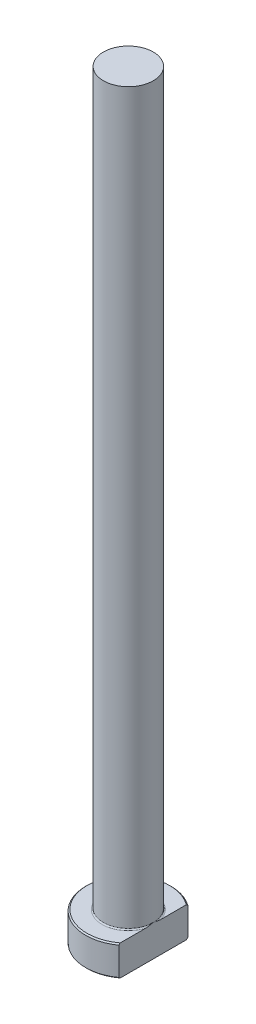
ISO-10303-21;
HEADER;
FILE_DESCRIPTION(('STEP AP214'),'2;1');
FILE_NAME('part.step','',(''),(''),'','','');
FILE_SCHEMA(('AUTOMOTIVE_DESIGN { 1 0 10303 214 1 1 1 1 }'));
ENDSEC;
DATA;
#1=APPLICATION_CONTEXT('core data for automotive mechanical design processes');
#2=APPLICATION_PROTOCOL_DEFINITION('international standard','automotive_design',2000,#1);
#3=PRODUCT_CONTEXT('',#1,'mechanical');
#4=PRODUCT('Part','Part','',(#3));
#5=PRODUCT_RELATED_PRODUCT_CATEGORY('part','',(#4));
#6=PRODUCT_DEFINITION_FORMATION('','',#4);
#7=PRODUCT_DEFINITION_CONTEXT('part definition',#1,'design');
#8=PRODUCT_DEFINITION('design','',#6,#7);
#9=PRODUCT_DEFINITION_SHAPE('','',#8);
#10=(LENGTH_UNIT() NAMED_UNIT(*) SI_UNIT(.MILLI.,.METRE.));
#11=(NAMED_UNIT(*) PLANE_ANGLE_UNIT() SI_UNIT($,.RADIAN.));
#12=(NAMED_UNIT(*) SI_UNIT($,.STERADIAN.) SOLID_ANGLE_UNIT());
#13=UNCERTAINTY_MEASURE_WITH_UNIT(LENGTH_MEASURE(1.E-05),#10,'distance_accuracy_value','');
#14=(GEOMETRIC_REPRESENTATION_CONTEXT(3) GLOBAL_UNCERTAINTY_ASSIGNED_CONTEXT((#13)) GLOBAL_UNIT_ASSIGNED_CONTEXT((#10,
#11,#12)) REPRESENTATION_CONTEXT('',''));
#15=CARTESIAN_POINT('',(0.,0.,0.));
#16=DIRECTION('',(0.,0.,1.));
#17=DIRECTION('',(1.,0.,0.));
#18=AXIS2_PLACEMENT_3D('',#15,#16,#17);
#19=CARTESIAN_POINT('',(0.,0.,0.));
#20=DIRECTION('',(0.,-1.,0.));
#21=DIRECTION('',(0.,0.,-1.));
#22=AXIS2_PLACEMENT_3D('',#19,#20,#21);
#23=PLANE('',#22);
#24=CARTESIAN_POINT('',(0.,0.,0.));
#25=DIRECTION('',(0.,-1.,0.));
#26=DIRECTION('',(0.,0.,-1.));
#27=AXIS2_PLACEMENT_3D('',#24,#25,#26);
#28=CIRCLE('',#27,6.8);
#29=CARTESIAN_POINT('',(4.09999999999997,0.,5.42494239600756));
#30=VERTEX_POINT('',#29);
#31=CARTESIAN_POINT('',(4.09999999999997,0.,-5.42494239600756));
#32=VERTEX_POINT('',#31);
#33=EDGE_CURVE('E98',#30,#32,#28,.T.);
#34=ORIENTED_EDGE('',*,*,#33,.T.);
#35=DIRECTION('',(0.,0.,1.));
#36=VECTOR('',#35,1.);
#37=CARTESIAN_POINT('',(4.09999999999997,0.,-5.6736231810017));
#38=LINE('',#37,#36);
#39=EDGE_CURVE('E83',#32,#30,#38,.T.);
#40=ORIENTED_EDGE('',*,*,#39,.T.);
#41=EDGE_LOOP('',(#34,#40));
#42=FACE_BOUND('',#41,.T.);
#43=ADVANCED_FACE('F32',(#42),#23,.T.);
#44=CARTESIAN_POINT('',(0.,259.958771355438,0.));
#45=DIRECTION('',(0.,1.,0.));
#46=DIRECTION('',(0.,0.,1.));
#47=AXIS2_PLACEMENT_3D('',#44,#45,#46);
#48=CYLINDRICAL_SURFACE('',#47,6.99999999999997);
#49=CARTESIAN_POINT('',(0.,4.80000000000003,0.));
#50=DIRECTION('',(0.,1.,0.));
#51=DIRECTION('',(0.,0.,1.));
#52=AXIS2_PLACEMENT_3D('',#49,#50,#51);
#53=CIRCLE('',#52,6.99999999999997);
#54=CARTESIAN_POINT('',(4.09999999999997,4.80000000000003,5.6736231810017));
#55=VERTEX_POINT('',#54);
#56=CARTESIAN_POINT('',(4.09999999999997,4.80000000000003,-5.6736231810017));
#57=VERTEX_POINT('',#56);
#58=EDGE_CURVE('E104',#55,#57,#53,.F.);
#59=ORIENTED_EDGE('',*,*,#58,.T.);
#60=DIRECTION('',(0.,-1.,0.));
#61=VECTOR('',#60,1.);
#62=CARTESIAN_POINT('',(4.09999999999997,125.,-5.6736231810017));
#63=LINE('',#62,#61);
#64=CARTESIAN_POINT('',(4.09999999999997,0.199999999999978,-5.6736231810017));
#65=VERTEX_POINT('',#64);
#66=EDGE_CURVE('E183',#57,#65,#63,.T.);
#67=ORIENTED_EDGE('',*,*,#66,.T.);
#68=CARTESIAN_POINT('',(0.,0.199999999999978,0.));
#69=DIRECTION('',(0.,-1.,0.));
#70=DIRECTION('',(0.,0.,-1.));
#71=AXIS2_PLACEMENT_3D('',#68,#69,#70);
#72=CIRCLE('',#71,6.99999999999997);
#73=CARTESIAN_POINT('',(4.09999999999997,0.199999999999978,5.6736231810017));
#74=VERTEX_POINT('',#73);
#75=EDGE_CURVE('E100',#65,#74,#72,.F.);
#76=ORIENTED_EDGE('',*,*,#75,.T.);
#77=DIRECTION('',(0.,-1.,0.));
#78=VECTOR('',#77,1.);
#79=CARTESIAN_POINT('',(4.09999999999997,125.,5.6736231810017));
#80=LINE('',#79,#78);
#81=EDGE_CURVE('E93',#55,#74,#80,.T.);
#82=ORIENTED_EDGE('',*,*,#81,.F.);
#83=EDGE_LOOP('',(#59,#67,#76,#82));
#84=FACE_BOUND('',#83,.T.);
#85=ADVANCED_FACE('F158',(#84),#48,.T.);
#86=CARTESIAN_POINT('',(-6.99999999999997,5.,0.));
#87=DIRECTION('',(0.,1.,0.));
#88=DIRECTION('',(0.,0.,1.));
#89=AXIS2_PLACEMENT_3D('',#86,#87,#88);
#90=PLANE('',#89);
#91=CARTESIAN_POINT('',(0.,5.,0.));
#92=DIRECTION('',(0.,1.,0.));
#93=DIRECTION('',(0.,0.,1.));
#94=AXIS2_PLACEMENT_3D('',#91,#92,#93);
#95=CIRCLE('',#94,6.79999999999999);
#96=CARTESIAN_POINT('',(4.09999999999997,5.,-5.42494239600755));
#97=VERTEX_POINT('',#96);
#98=CARTESIAN_POINT('',(4.09999999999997,5.,5.42494239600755));
#99=VERTEX_POINT('',#98);
#100=EDGE_CURVE('E178',#97,#99,#95,.T.);
#101=ORIENTED_EDGE('',*,*,#100,.T.);
#102=DIRECTION('',(0.,0.,-1.));
#103=VECTOR('',#102,1.);
#104=CARTESIAN_POINT('',(4.09999999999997,5.,0.));
#105=LINE('',#104,#103);
#106=CARTESIAN_POINT('',(4.09999999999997,4.99999999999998,1.29614813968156));
#107=VERTEX_POINT('',#106);
#108=EDGE_CURVE('E57',#99,#107,#105,.T.);
#109=ORIENTED_EDGE('',*,*,#108,.T.);
#110=CARTESIAN_POINT('',(0.,5.,0.));
#111=DIRECTION('',(0.,1.,0.));
#112=DIRECTION('',(0.,0.,1.));
#113=AXIS2_PLACEMENT_3D('',#110,#111,#112);
#114=CIRCLE('',#113,4.29999999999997);
#115=CARTESIAN_POINT('',(4.09999999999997,4.99999999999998,-1.29614813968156));
#116=VERTEX_POINT('',#115);
#117=EDGE_CURVE('E107',#107,#116,#114,.F.);
#118=ORIENTED_EDGE('',*,*,#117,.T.);
#119=EDGE_CURVE('E136',#116,#97,#105,.T.);
#120=ORIENTED_EDGE('',*,*,#119,.T.);
#121=EDGE_LOOP('',(#101,#109,#118,#120));
#122=FACE_BOUND('',#121,.T.);
#123=ADVANCED_FACE('F147',(#122),#90,.T.);
#124=CARTESIAN_POINT('',(0.,5.,0.));
#125=DIRECTION('',(0.,-1.,0.));
#126=DIRECTION('',(0.,0.,-1.));
#127=AXIS2_PLACEMENT_3D('',#124,#125,#126);
#128=CONICAL_SURFACE('',#127,6.79999999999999,0.785398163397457);
#129=ORIENTED_EDGE('',*,*,#58,.F.);
#130=CARTESIAN_POINT('',(4.09999999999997,-1.33929192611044,12.483228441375));
#131=CARTESIAN_POINT('',(4.09999999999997,-1.13691180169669,12.2702073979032));
#132=CARTESIAN_POINT('',(4.09999999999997,-0.934791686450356,12.0569390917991));
#133=CARTESIAN_POINT('',(4.09999999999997,-0.531169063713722,11.6298164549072));
#134=CARTESIAN_POINT('',(4.09999999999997,-0.329666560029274,11.4159621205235));
#135=CARTESIAN_POINT('',(4.09999999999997,0.273965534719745,10.7731725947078));
#136=CARTESIAN_POINT('',(4.09999999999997,0.675017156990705,10.3432236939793));
#137=CARTESIAN_POINT('',(4.09999999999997,1.47875431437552,9.47345436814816));
#138=CARTESIAN_POINT('',(4.09999999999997,1.8813821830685,9.03358046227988));
#139=CARTESIAN_POINT('',(4.09999999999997,2.48056970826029,8.36963259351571));
#140=CARTESIAN_POINT('',(4.09999999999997,2.6794685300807,8.14767042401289));
#141=CARTESIAN_POINT('',(4.09999999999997,3.07530374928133,7.70200314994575));
#142=CARTESIAN_POINT('',(4.09999999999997,3.27224016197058,7.4782980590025));
#143=CARTESIAN_POINT('',(4.09999999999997,3.62803580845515,7.0695950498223));
#144=CARTESIAN_POINT('',(4.09999999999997,3.78730687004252,6.88495594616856));
#145=CARTESIAN_POINT('',(4.09999999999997,4.10378434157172,6.51391771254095));
#146=CARTESIAN_POINT('',(4.09999999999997,4.26099077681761,6.32751860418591));
#147=CARTESIAN_POINT('',(4.09999999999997,4.57299335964,5.95235210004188));
#148=CARTESIAN_POINT('',(4.09999999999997,4.72778657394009,5.76358225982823));
#149=CARTESIAN_POINT('',(4.09999999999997,5.03405385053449,5.38337519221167));
#150=CARTESIAN_POINT('',(4.09999999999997,5.1855280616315,5.19193808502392));
#151=CARTESIAN_POINT('',(4.09999999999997,5.48381165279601,4.80616050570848));
#152=CARTESIAN_POINT('',(4.09999999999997,5.63063104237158,4.61182780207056));
#153=CARTESIAN_POINT('',(4.09999999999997,5.91857329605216,4.21889561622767));
#154=CARTESIAN_POINT('',(4.09999999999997,6.05969490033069,4.02029520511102));
#155=CARTESIAN_POINT('',(4.09999999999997,6.33384612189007,3.61807653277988));
#156=CARTESIAN_POINT('',(4.09999999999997,6.46688994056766,3.4144680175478));
#157=CARTESIAN_POINT('',(4.09999999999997,6.72196289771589,3.00051329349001));
#158=CARTESIAN_POINT('',(4.09999999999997,6.84399822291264,2.79017096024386));
#159=CARTESIAN_POINT('',(4.09999999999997,7.04294800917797,2.41613627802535));
#160=CARTESIAN_POINT('',(4.09999999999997,7.12340018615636,2.25434092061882));
#161=CARTESIAN_POINT('',(4.09999999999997,7.27278814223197,1.92538984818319));
#162=CARTESIAN_POINT('',(4.09999999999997,7.34172134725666,1.75823294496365));
#163=CARTESIAN_POINT('',(4.09999999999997,7.46395062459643,1.41984946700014));
#164=CARTESIAN_POINT('',(4.09999999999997,7.51737823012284,1.24867129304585));
#165=CARTESIAN_POINT('',(4.09999999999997,7.60539482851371,0.901532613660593));
#166=CARTESIAN_POINT('',(4.09999999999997,7.63999996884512,0.72557634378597));
#167=CARTESIAN_POINT('',(4.09999999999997,7.68036353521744,0.421086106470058));
#168=CARTESIAN_POINT('',(4.09999999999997,7.69152054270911,0.293260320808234));
#169=CARTESIAN_POINT('',(4.09999999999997,7.70182627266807,0.0371280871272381));
#170=CARTESIAN_POINT('',(4.09999999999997,7.70097696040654,-0.0911782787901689));
#171=CARTESIAN_POINT('',(4.09999999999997,7.68730446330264,-0.347367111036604));
#172=CARTESIAN_POINT('',(4.09999999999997,7.67446010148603,-0.475248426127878));
#173=CARTESIAN_POINT('',(4.09999999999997,7.63752967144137,-0.729373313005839));
#174=CARTESIAN_POINT('',(4.09999999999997,7.61344101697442,-0.855616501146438));
#175=CARTESIAN_POINT('',(4.09999999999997,7.54404317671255,-1.15392625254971));
#176=CARTESIAN_POINT('',(4.09999999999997,7.49413451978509,-1.324920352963));
#177=CARTESIAN_POINT('',(4.09999999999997,7.37892989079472,-1.66161692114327));
#178=CARTESIAN_POINT('',(4.09999999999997,7.31362410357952,-1.82731593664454));
#179=CARTESIAN_POINT('',(4.09999999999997,7.17079959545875,-2.15435858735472));
#180=CARTESIAN_POINT('',(4.09999999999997,7.09321727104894,-2.31567410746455));
#181=CARTESIAN_POINT('',(4.09999999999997,6.97004119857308,-2.55403843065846));
#182=CARTESIAN_POINT('',(4.09999999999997,6.92785402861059,-2.63288278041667));
#183=CARTESIAN_POINT('',(4.09999999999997,6.84148468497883,-2.78946923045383));
#184=CARTESIAN_POINT('',(4.09999999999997,6.79730258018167,-2.86721136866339));
#185=CARTESIAN_POINT('',(4.09999999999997,6.65934609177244,-3.10372248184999));
#186=CARTESIAN_POINT('',(4.09999999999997,6.56274427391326,-3.26084376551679));
#187=CARTESIAN_POINT('',(4.09999999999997,6.36389133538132,-3.57148434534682));
#188=CARTESIAN_POINT('',(4.09999999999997,6.26163896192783,-3.72500283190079));
#189=CARTESIAN_POINT('',(4.09999999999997,6.05267831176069,-4.02913378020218));
#190=CARTESIAN_POINT('',(4.09999999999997,5.94596678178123,-4.17974399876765));
#191=CARTESIAN_POINT('',(4.09999999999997,5.72908222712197,-4.47845767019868));
#192=CARTESIAN_POINT('',(4.09999999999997,5.61890895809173,-4.62656094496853));
#193=CARTESIAN_POINT('',(4.09999999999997,5.39553225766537,-4.92101937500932));
#194=CARTESIAN_POINT('',(4.09999999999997,5.28232219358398,-5.06736948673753));
#195=CARTESIAN_POINT('',(4.09999999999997,5.05364560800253,-5.35829836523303));
#196=CARTESIAN_POINT('',(4.09999999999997,4.93817902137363,-5.5028770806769));
#197=CARTESIAN_POINT('',(4.09999999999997,4.58900487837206,-5.93440610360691));
#198=CARTESIAN_POINT('',(4.09999999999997,4.35254037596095,-6.21912657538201));
#199=CARTESIAN_POINT('',(4.09999999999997,3.99368021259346,-6.64336157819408));
#200=CARTESIAN_POINT('',(4.09999999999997,3.87318866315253,-6.7845013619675));
#201=CARTESIAN_POINT('',(4.09999999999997,3.63111125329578,-7.06582575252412));
#202=CARTESIAN_POINT('',(4.09999999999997,3.50952545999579,-7.20601041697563));
#203=CARTESIAN_POINT('',(4.09999999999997,3.14334067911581,-7.62537642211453));
#204=CARTESIAN_POINT('',(4.09999999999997,2.89734299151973,-7.90333600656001));
#205=CARTESIAN_POINT('',(4.09999999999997,2.4029383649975,-8.45636150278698));
#206=CARTESIAN_POINT('',(4.09999999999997,2.15453550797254,-8.73143107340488));
#207=CARTESIAN_POINT('',(4.09999999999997,1.65560568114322,-9.27963529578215));
#208=CARTESIAN_POINT('',(4.09999999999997,1.40507871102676,-9.55276994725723));
#209=CARTESIAN_POINT('',(4.09999999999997,0.947239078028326,-10.0488717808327));
#210=CARTESIAN_POINT('',(4.09999999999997,0.740197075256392,-10.272089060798));
#211=CARTESIAN_POINT('',(4.09999999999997,0.32511671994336,-10.7177199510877));
#212=CARTESIAN_POINT('',(4.09999999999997,0.117078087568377,-10.9401333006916));
#213=CARTESIAN_POINT('',(4.09999999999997,-0.298674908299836,-11.3830462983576));
#214=CARTESIAN_POINT('',(4.09999999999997,-0.506385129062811,-11.6035498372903));
#215=CARTESIAN_POINT('',(4.09999999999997,-0.922403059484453,-12.0438652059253));
#216=CARTESIAN_POINT('',(4.09999999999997,-1.1307105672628,-12.2636772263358));
#217=CARTESIAN_POINT('',(4.09999999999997,-1.33929192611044,-12.483228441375));
#218=B_SPLINE_CURVE_WITH_KNOTS('',3,(#130,#131,#132,#133,#134,#135,#136,#137,#138,#139,#140,
#141,#142,#143,#144,#145,#146,#147,#148,#149,#150,#151,#152,#153,#154,#155,#156,#157,#158,#159,
#160,#161,#162,#163,#164,#165,#166,#167,#168,#169,#170,#171,#172,#173,#174,#175,#176,#177,#178,
#179,#180,#181,#182,#183,#184,#185,#186,#187,#188,#189,#190,#191,#192,#193,#194,#195,#196,#197,
#198,#199,#200,#201,#202,#203,#204,#205,#206,#207,#208,#209,#210,#211,#212,#213,#214,#215,#216,
#217),.UNSPECIFIED.,.F.,.F.,(4,2,2,2,2,2,2,2,2,2,2,2,2,2,2,2,2,2,2,2,2,2,2,2,2,2,2,2,2,2,2,2,2,
2,2,2,2,2,2,2,2,2,2,4),(0.,0.881487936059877,1.76298129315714,3.5268493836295,5.31576438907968,
6.20987642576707,7.10398148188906,7.8354952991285,8.56700014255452,9.2993339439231,
10.0316348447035,10.7622363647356,11.4929985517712,12.2224363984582,12.9514617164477,
13.4932089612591,14.0350771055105,14.5722044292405,15.1088702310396,15.4932846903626,
15.8776362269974,16.2626676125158,16.6477876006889,17.1811942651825,17.7149418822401,
18.2515512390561,18.519793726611,18.7880269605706,19.3411787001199,19.8944535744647,
20.4481394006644,21.00186439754,21.5569172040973,22.111986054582,23.2222096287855,
23.7789368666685,24.3356301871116,25.449149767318,26.5610293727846,27.6729091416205,
28.5862688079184,29.4999020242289,30.4086844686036,31.3171893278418),.UNSPECIFIED.);
#219=EDGE_CURVE('E135',#55,#99,#218,.T.);
#220=ORIENTED_EDGE('',*,*,#219,.T.);
#221=ORIENTED_EDGE('',*,*,#100,.F.);
#222=EDGE_CURVE('E127',#97,#57,#218,.T.);
#223=ORIENTED_EDGE('',*,*,#222,.T.);
#224=EDGE_LOOP('',(#129,#220,#221,#223));
#225=FACE_BOUND('',#224,.T.);
#226=ADVANCED_FACE('F143',(#225),#128,.T.);
#227=CARTESIAN_POINT('',(0.,0.199999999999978,0.));
#228=DIRECTION('',(0.,1.,0.));
#229=DIRECTION('',(0.,0.,1.));
#230=AXIS2_PLACEMENT_3D('',#227,#228,#229);
#231=CONICAL_SURFACE('',#230,6.99999999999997,0.785398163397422);
#232=ORIENTED_EDGE('',*,*,#75,.F.);
#233=CARTESIAN_POINT('',(4.09999999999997,6.33929192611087,-12.483228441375));
#234=CARTESIAN_POINT('',(4.09999999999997,6.13691180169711,-12.2702073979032));
#235=CARTESIAN_POINT('',(4.09999999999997,5.93479168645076,-12.0569390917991));
#236=CARTESIAN_POINT('',(4.09999999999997,5.53116906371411,-11.6298164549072));
#237=CARTESIAN_POINT('',(4.09999999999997,5.32966656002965,-11.4159621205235));
#238=CARTESIAN_POINT('',(4.09999999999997,4.72603446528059,-10.7731725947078));
#239=CARTESIAN_POINT('',(4.09999999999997,4.3249828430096,-10.3432236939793));
#240=CARTESIAN_POINT('',(4.09999999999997,3.52124568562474,-9.47345436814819));
#241=CARTESIAN_POINT('',(4.09999999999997,3.11861781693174,-9.03358046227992));
#242=CARTESIAN_POINT('',(4.09999999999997,2.51943029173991,-8.36963259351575));
#243=CARTESIAN_POINT('',(4.09999999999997,2.32053146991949,-8.14767042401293));
#244=CARTESIAN_POINT('',(4.09999999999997,1.92469625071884,-7.70200314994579));
#245=CARTESIAN_POINT('',(4.09999999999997,1.72775983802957,-7.47829805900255));
#246=CARTESIAN_POINT('',(4.09999999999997,1.37196419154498,-7.06959504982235));
#247=CARTESIAN_POINT('',(4.09999999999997,1.2126931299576,-6.88495594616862));
#248=CARTESIAN_POINT('',(4.09999999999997,0.896215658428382,-6.51391771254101));
#249=CARTESIAN_POINT('',(4.09999999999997,0.739009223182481,-6.32751860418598));
#250=CARTESIAN_POINT('',(4.09999999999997,0.427006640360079,-5.95235210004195));
#251=CARTESIAN_POINT('',(4.09999999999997,0.272213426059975,-5.7635822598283));
#252=CARTESIAN_POINT('',(4.09999999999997,-0.0340538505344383,-5.38337519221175));
#253=CARTESIAN_POINT('',(4.09999999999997,-0.18552806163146,-5.191938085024));
#254=CARTESIAN_POINT('',(4.09999999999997,-0.483811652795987,-4.80616050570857));
#255=CARTESIAN_POINT('',(4.09999999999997,-0.63063104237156,-4.61182780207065));
#256=CARTESIAN_POINT('',(4.09999999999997,-0.918573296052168,-4.21889561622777));
#257=CARTESIAN_POINT('',(4.09999999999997,-1.0596949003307,-4.02029520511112));
#258=CARTESIAN_POINT('',(4.09999999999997,-1.3338461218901,-3.61807653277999));
#259=CARTESIAN_POINT('',(4.09999999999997,-1.46688994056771,-3.41446801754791));
#260=CARTESIAN_POINT('',(4.09999999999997,-1.72196289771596,-3.00051329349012));
#261=CARTESIAN_POINT('',(4.09999999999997,-1.84399822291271,-2.79017096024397));
#262=CARTESIAN_POINT('',(4.09999999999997,-2.04294800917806,-2.41613627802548));
#263=CARTESIAN_POINT('',(4.09999999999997,-2.12340018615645,-2.25434092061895));
#264=CARTESIAN_POINT('',(4.09999999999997,-2.27278814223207,-1.92538984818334));
#265=CARTESIAN_POINT('',(4.09999999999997,-2.34172134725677,-1.7582329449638));
#266=CARTESIAN_POINT('',(4.09999999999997,-2.46395062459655,-1.41984946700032));
#267=CARTESIAN_POINT('',(4.09999999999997,-2.51737823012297,-1.24867129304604));
#268=CARTESIAN_POINT('',(4.09999999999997,-2.60539482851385,-0.901532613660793));
#269=CARTESIAN_POINT('',(4.09999999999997,-2.63999996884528,-0.725576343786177));
#270=CARTESIAN_POINT('',(4.09999999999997,-2.68036353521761,-0.421086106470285));
#271=CARTESIAN_POINT('',(4.09999999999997,-2.69152054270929,-0.293260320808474));
#272=CARTESIAN_POINT('',(4.09999999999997,-2.70182627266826,-0.0371280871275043));
#273=CARTESIAN_POINT('',(4.09999999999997,-2.70097696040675,0.0911782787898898));
#274=CARTESIAN_POINT('',(4.09999999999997,-2.68730446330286,0.347367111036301));
#275=CARTESIAN_POINT('',(4.09999999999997,-2.67446010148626,0.475248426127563));
#276=CARTESIAN_POINT('',(4.09999999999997,-2.63752967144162,0.729373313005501));
#277=CARTESIAN_POINT('',(4.09999999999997,-2.61344101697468,0.855616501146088));
#278=CARTESIAN_POINT('',(4.09999999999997,-2.54404317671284,1.15392625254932));
#279=CARTESIAN_POINT('',(4.09999999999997,-2.4941345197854,1.32492035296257));
#280=CARTESIAN_POINT('',(4.09999999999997,-2.37892989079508,1.66161692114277));
#281=CARTESIAN_POINT('',(4.09999999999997,-2.3136241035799,1.82731593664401));
#282=CARTESIAN_POINT('',(4.09999999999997,-2.17079959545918,2.15435858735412));
#283=CARTESIAN_POINT('',(4.09999999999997,-2.09321727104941,2.31567410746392));
#284=CARTESIAN_POINT('',(4.09999999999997,-1.97004119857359,2.55403843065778));
#285=CARTESIAN_POINT('',(4.09999999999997,-1.92785402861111,2.63288278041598));
#286=CARTESIAN_POINT('',(4.09999999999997,-1.84148468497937,2.78946923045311));
#287=CARTESIAN_POINT('',(4.09999999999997,-1.79730258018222,2.86721136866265));
#288=CARTESIAN_POINT('',(4.09999999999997,-1.65934609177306,3.10372248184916));
#289=CARTESIAN_POINT('',(4.09999999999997,-1.56274427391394,3.26084376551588));
#290=CARTESIAN_POINT('',(4.09999999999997,-1.36389133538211,3.57148434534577));
#291=CARTESIAN_POINT('',(4.09999999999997,-1.26163896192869,3.72500283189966));
#292=CARTESIAN_POINT('',(4.09999999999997,-1.05267831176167,4.0291337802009));
#293=CARTESIAN_POINT('',(4.09999999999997,-0.945966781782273,4.17974399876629));
#294=CARTESIAN_POINT('',(4.09999999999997,-0.729082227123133,4.47845767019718));
#295=CARTESIAN_POINT('',(4.09999999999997,-0.618908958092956,4.62656094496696));
#296=CARTESIAN_POINT('',(4.09999999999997,-0.395532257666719,4.92101937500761));
#297=CARTESIAN_POINT('',(4.09999999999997,-0.282322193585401,5.06736948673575));
#298=CARTESIAN_POINT('',(4.09999999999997,-0.0536456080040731,5.3582983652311));
#299=CARTESIAN_POINT('',(4.09999999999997,0.0618209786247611,5.50287708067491));
#300=CARTESIAN_POINT('',(4.09999999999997,0.410995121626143,5.9344061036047));
#301=CARTESIAN_POINT('',(4.09999999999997,0.647459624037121,6.21912657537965));
#302=CARTESIAN_POINT('',(4.09999999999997,1.00631978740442,6.64336157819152));
#303=CARTESIAN_POINT('',(4.09999999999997,1.12681133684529,6.78450136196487));
#304=CARTESIAN_POINT('',(4.09999999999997,1.36888874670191,7.06582575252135));
#305=CARTESIAN_POINT('',(4.09999999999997,1.49047454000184,7.20601041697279));
#306=CARTESIAN_POINT('',(4.09999999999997,1.85665932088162,7.62537642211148));
#307=CARTESIAN_POINT('',(4.09999999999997,2.10265700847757,7.90333600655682));
#308=CARTESIAN_POINT('',(4.09999999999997,2.59706163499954,8.45636150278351));
#309=CARTESIAN_POINT('',(4.09999999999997,2.84546449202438,8.73143107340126));
#310=CARTESIAN_POINT('',(4.09999999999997,3.34439431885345,9.27963529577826));
#311=CARTESIAN_POINT('',(4.09999999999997,3.59492128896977,9.5527699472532));
#312=CARTESIAN_POINT('',(4.09999999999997,4.05276092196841,10.0488717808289));
#313=CARTESIAN_POINT('',(4.09999999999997,4.25980292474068,10.2720890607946));
#314=CARTESIAN_POINT('',(4.09999999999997,4.67488328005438,10.7177199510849));
#315=CARTESIAN_POINT('',(4.09999999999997,4.8829219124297,10.9401333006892));
#316=CARTESIAN_POINT('',(4.09999999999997,5.29867490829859,11.3830462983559));
#317=CARTESIAN_POINT('',(4.09999999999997,5.50638512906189,11.6035498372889));
#318=CARTESIAN_POINT('',(4.09999999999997,5.92240305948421,12.0438652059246));
#319=CARTESIAN_POINT('',(4.09999999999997,6.13071056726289,12.2636772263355));
#320=CARTESIAN_POINT('',(4.09999999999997,6.33929192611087,12.483228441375));
#321=B_SPLINE_CURVE_WITH_KNOTS('',3,(#233,#234,#235,#236,#237,#238,#239,#240,#241,#242,#243,
#244,#245,#246,#247,#248,#249,#250,#251,#252,#253,#254,#255,#256,#257,#258,#259,#260,#261,#262,
#263,#264,#265,#266,#267,#268,#269,#270,#271,#272,#273,#274,#275,#276,#277,#278,#279,#280,#281,
#282,#283,#284,#285,#286,#287,#288,#289,#290,#291,#292,#293,#294,#295,#296,#297,#298,#299,#300,
#301,#302,#303,#304,#305,#306,#307,#308,#309,#310,#311,#312,#313,#314,#315,#316,#317,#318,#319,
#320),.UNSPECIFIED.,.F.,.F.,(4,2,2,2,2,2,2,2,2,2,2,2,2,2,2,2,2,2,2,2,2,2,2,2,2,2,2,2,2,2,2,2,2,
2,2,2,2,2,2,2,2,2,2,4),(0.,0.881487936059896,1.76298129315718,3.52684938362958,5.3157643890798,
6.20987642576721,7.10398148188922,7.83549529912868,8.5670001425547,9.29933394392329,
10.0316348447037,10.7622363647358,11.4929985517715,12.2224363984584,12.9514617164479,
13.4932089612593,14.0350771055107,14.5722044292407,15.1088702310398,15.4932846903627,
15.8776362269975,16.2626676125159,16.6477876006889,17.1811942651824,17.7149418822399,
18.2515512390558,18.5197937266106,18.7880269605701,19.3411787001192,19.8944535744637,
20.4481394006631,21.0018643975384,21.5569172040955,22.1119860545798,23.2222096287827,
23.7789368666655,24.3356301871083,25.4491497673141,26.5610293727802,27.6729091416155,
28.5862688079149,29.4999020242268,30.4086844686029,31.3171893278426),.UNSPECIFIED.);
#322=EDGE_CURVE('E86',#65,#32,#321,.T.);
#323=ORIENTED_EDGE('',*,*,#322,.T.);
#324=ORIENTED_EDGE('',*,*,#33,.F.);
#325=EDGE_CURVE('E89',#30,#74,#321,.T.);
#326=ORIENTED_EDGE('',*,*,#325,.T.);
#327=EDGE_LOOP('',(#232,#323,#324,#326));
#328=FACE_BOUND('',#327,.T.);
#329=ADVANCED_FACE('F97',(#328),#231,.T.);
#330=CARTESIAN_POINT('',(0.,5.19999999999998,0.));
#331=DIRECTION('',(0.,1.,0.));
#332=DIRECTION('',(0.,0.,1.));
#333=AXIS2_PLACEMENT_3D('',#330,#331,#332);
#334=TOROIDAL_SURFACE('',#333,4.29999999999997,0.2);
#335=CARTESIAN_POINT('',(4.09999999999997,5.19999999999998,0.));
#336=CARTESIAN_POINT('',(4.09999999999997,5.20000051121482,8.48177579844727E-11));
#337=CARTESIAN_POINT('',(4.09999999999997,5.2000010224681,-2.37341874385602E-07));
#338=CARTESIAN_POINT('',(4.09999999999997,5.20000197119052,-8.69991321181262E-07));
#339=CARTESIAN_POINT('',(4.09999999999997,5.20000238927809,-1.28223494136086E-06));
#340=CARTESIAN_POINT('',(4.09999999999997,5.20000327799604,-2.27653388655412E-06));
#341=CARTESIAN_POINT('',(4.09999999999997,5.20000373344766,-2.87471299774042E-06));
#342=CARTESIAN_POINT('',(4.09999999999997,5.20000453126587,-4.09830357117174E-06));
#343=CARTESIAN_POINT('',(4.09999999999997,5.20000487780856,-4.72126748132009E-06));
#344=CARTESIAN_POINT('',(4.09999999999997,5.20000620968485,-7.19543436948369E-06));
#345=CARTESIAN_POINT('',(4.09999999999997,5.20000713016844,-9.08507628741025E-06));
#346=CARTESIAN_POINT('',(4.09999999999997,5.20000860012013,-1.27786167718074E-05));
#347=CARTESIAN_POINT('',(4.09999999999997,5.2000091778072,-1.45716794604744E-05));
#348=CARTESIAN_POINT('',(4.09999999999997,5.20001167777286,-2.23278313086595E-05));
#349=CARTESIAN_POINT('',(4.09999999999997,5.20001360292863,-2.82919348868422E-05));
#350=CARTESIAN_POINT('',(4.09999999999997,5.20001636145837,-3.94393207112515E-05));
#351=CARTESIAN_POINT('',(4.09999999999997,5.20001732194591,-4.459065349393E-05));
#352=CARTESIAN_POINT('',(4.09999999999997,5.20002443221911,-8.33481274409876E-05));
#353=CARTESIAN_POINT('',(4.09999999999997,5.20002995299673,-0.000117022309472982));
#354=CARTESIAN_POINT('',(4.09999999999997,5.20005411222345,-0.000250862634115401));
#355=CARTESIAN_POINT('',(4.09999999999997,5.20007702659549,-0.000350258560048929));
#356=CARTESIAN_POINT('',(4.09999999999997,5.20016686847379,-0.000745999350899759));
#357=CARTESIAN_POINT('',(4.09999999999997,5.20023113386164,-0.00104273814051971));
#358=CARTESIAN_POINT('',(4.09999999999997,5.20048975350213,-0.00222871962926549));
#359=CARTESIAN_POINT('',(4.09999999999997,5.20068752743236,-0.00311743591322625));
#360=CARTESIAN_POINT('',(4.09999999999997,5.20151360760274,-0.00683863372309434));
#361=CARTESIAN_POINT('',(4.09999999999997,5.20213761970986,-0.00967177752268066));
#362=CARTESIAN_POINT('',(4.09999999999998,5.21060513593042,-0.0481053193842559));
#363=CARTESIAN_POINT('',(4.09999999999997,5.21847514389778,-0.0837019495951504));
#364=CARTESIAN_POINT('',(4.09999999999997,5.23497753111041,-0.15888321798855));
#365=CARTESIAN_POINT('',(4.09999999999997,5.24359721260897,-0.198470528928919));
#366=CARTESIAN_POINT('',(4.09999999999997,5.25810552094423,-0.266014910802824));
#367=CARTESIAN_POINT('',(4.09999999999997,5.26405008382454,-0.293959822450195));
#368=CARTESIAN_POINT('',(4.09999999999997,5.27562355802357,-0.34912552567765));
#369=CARTESIAN_POINT('',(4.09999999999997,5.28125665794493,-0.376345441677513));
#370=CARTESIAN_POINT('',(4.09999999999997,5.29943979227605,-0.46575599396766));
#371=CARTESIAN_POINT('',(4.09999999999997,5.31159607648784,-0.528028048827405));
#372=CARTESIAN_POINT('',(4.09999999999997,5.3345183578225,-0.653452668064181));
#373=CARTESIAN_POINT('',(4.09999999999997,5.34526982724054,-0.716607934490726));
#374=CARTESIAN_POINT('',(4.09999999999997,5.36549989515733,-0.849208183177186));
#375=CARTESIAN_POINT('',(4.09999999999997,5.37476398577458,-0.918686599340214));
#376=CARTESIAN_POINT('',(4.09999999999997,5.38955225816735,-1.05786044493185));
#377=CARTESIAN_POINT('',(4.09999999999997,5.39508786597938,-1.12755454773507));
#378=CARTESIAN_POINT('',(4.09999999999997,5.3992964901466,-1.23112590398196));
#379=CARTESIAN_POINT('',(4.09999999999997,5.40003705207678,-1.26491756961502));
#380=CARTESIAN_POINT('',(4.09999999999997,5.39995996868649,-1.33249559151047));
#381=CARTESIAN_POINT('',(4.09999999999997,5.39914270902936,-1.36628194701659));
#382=CARTESIAN_POINT('',(4.09999999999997,5.39557880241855,-1.43339843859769));
#383=CARTESIAN_POINT('',(4.09999999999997,5.39285312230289,-1.46672955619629));
#384=CARTESIAN_POINT('',(4.09999999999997,5.3849220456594,-1.53304911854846));
#385=CARTESIAN_POINT('',(4.09999999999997,5.37972044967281,-1.56603800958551));
#386=CARTESIAN_POINT('',(4.09999999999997,5.36576321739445,-1.63210333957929));
#387=CARTESIAN_POINT('',(4.09999999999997,5.35693238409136,-1.66516593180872));
#388=CARTESIAN_POINT('',(4.09999999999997,5.33956496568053,-1.71313701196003));
#389=CARTESIAN_POINT('',(4.09999999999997,5.33312382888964,-1.72879572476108));
#390=CARTESIAN_POINT('',(4.09999999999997,5.31841020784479,-1.75921181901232));
#391=CARTESIAN_POINT('',(4.09999999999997,5.31014484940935,-1.77397243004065));
#392=CARTESIAN_POINT('',(4.09999999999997,5.29597609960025,-1.79459137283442));
#393=CARTESIAN_POINT('',(4.09999999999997,5.29105059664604,-1.80111732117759));
#394=CARTESIAN_POINT('',(4.09999999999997,5.28047159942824,-1.81356806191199));
#395=CARTESIAN_POINT('',(4.09999999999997,5.27481806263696,-1.81949281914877));
#396=CARTESIAN_POINT('',(4.09999999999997,5.26378662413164,-1.82942177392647));
#397=CARTESIAN_POINT('',(4.09999999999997,5.25854825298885,-1.83357893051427));
#398=CARTESIAN_POINT('',(4.09999999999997,5.24747881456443,-1.8410175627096));
#399=CARTESIAN_POINT('',(4.09999999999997,5.24164898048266,-1.84430081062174));
#400=CARTESIAN_POINT('',(4.09999999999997,5.23103019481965,-1.84897077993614));
#401=CARTESIAN_POINT('',(4.09999999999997,5.22636142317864,-1.85062832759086));
#402=CARTESIAN_POINT('',(4.09999999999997,5.21681344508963,-1.85314556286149));
#403=CARTESIAN_POINT('',(4.09999999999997,5.21193447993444,-1.85400614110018));
#404=CARTESIAN_POINT('',(4.09999999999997,5.2020790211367,-1.8548454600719));
#405=CARTESIAN_POINT('',(4.09999999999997,5.19710220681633,-1.85482052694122));
#406=CARTESIAN_POINT('',(4.09999999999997,5.18723254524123,-1.85388227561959));
#407=CARTESIAN_POINT('',(4.09999999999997,5.18233974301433,-1.8529684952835));
#408=CARTESIAN_POINT('',(4.09999999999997,5.17301169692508,-1.85041011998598));
#409=CARTESIAN_POINT('',(4.09999999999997,5.16856577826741,-1.84880345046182));
#410=CARTESIAN_POINT('',(4.09999999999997,5.15994310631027,-1.84499014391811));
#411=CARTESIAN_POINT('',(4.09999999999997,5.15576643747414,-1.84278331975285));
#412=CARTESIAN_POINT('',(4.09999999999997,5.1448604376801,-1.83616140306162));
#413=CARTESIAN_POINT('',(4.09999999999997,5.13841060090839,-1.8312871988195));
#414=CARTESIAN_POINT('',(4.09999999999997,5.12632402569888,-1.82061430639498));
#415=CARTESIAN_POINT('',(4.09999999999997,5.12069027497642,-1.81481237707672));
#416=CARTESIAN_POINT('',(4.09999999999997,5.10569835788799,-1.79748307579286));
#417=CARTESIAN_POINT('',(4.09999999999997,5.0971810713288,-1.78523612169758));
#418=CARTESIAN_POINT('',(4.09999999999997,5.08190874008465,-1.759730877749));
#419=CARTESIAN_POINT('',(4.09999999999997,5.07515617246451,-1.74647119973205));
#420=CARTESIAN_POINT('',(4.09999999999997,5.06057670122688,-1.71404296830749));
#421=CARTESIAN_POINT('',(4.09999999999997,5.05336936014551,-1.69459894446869));
#422=CARTESIAN_POINT('',(4.09999999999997,5.04078670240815,-1.65511361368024));
#423=CARTESIAN_POINT('',(4.09999999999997,5.03541518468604,-1.63507116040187));
#424=CARTESIAN_POINT('',(4.09999999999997,5.02602669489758,-1.59438056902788));
#425=CARTESIAN_POINT('',(4.09999999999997,5.02202979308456,-1.57372787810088));
#426=CARTESIAN_POINT('',(4.09999999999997,5.01520764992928,-1.53226128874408));
#427=CARTESIAN_POINT('',(4.09999999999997,5.01238102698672,-1.51144761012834));
#428=CARTESIAN_POINT('',(4.09999999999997,5.00618826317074,-1.45642510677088));
#429=CARTESIAN_POINT('',(4.09999999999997,5.00362476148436,-1.42212636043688));
#430=CARTESIAN_POINT('',(4.09999999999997,5.00045800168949,-1.35343324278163));
#431=CARTESIAN_POINT('',(4.09999999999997,4.99985588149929,-1.31903882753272));
#432=CARTESIAN_POINT('',(4.09999999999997,5.00037893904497,-1.21560964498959));
#433=CARTESIAN_POINT('',(4.09999999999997,5.00385566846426,-1.14658832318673));
#434=CARTESIAN_POINT('',(4.09999999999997,5.01464295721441,-1.01357004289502));
#435=CARTESIAN_POINT('',(4.09999999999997,5.02167983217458,-0.949547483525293));
#436=CARTESIAN_POINT('',(4.09999999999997,5.03833051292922,-0.822416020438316));
#437=CARTESIAN_POINT('',(4.09999999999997,5.04792112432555,-0.759304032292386));
#438=CARTESIAN_POINT('',(4.09999999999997,5.06649836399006,-0.648156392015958));
#439=CARTESIAN_POINT('',(4.09999999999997,5.07509963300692,-0.60005440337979));
#440=CARTESIAN_POINT('',(4.09999999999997,5.09336865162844,-0.5027171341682));
#441=CARTESIAN_POINT('',(4.09999999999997,5.10305882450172,-0.45348607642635));
#442=CARTESIAN_POINT('',(4.09999999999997,5.12010265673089,-0.369650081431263));
#443=CARTESIAN_POINT('',(4.09999999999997,5.1273025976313,-0.335013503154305));
#444=CARTESIAN_POINT('',(4.09999999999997,5.14184386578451,-0.26617579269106));
#445=CARTESIAN_POINT('',(4.09999999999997,5.14918270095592,-0.231974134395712));
#446=CARTESIAN_POINT('',(4.09999999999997,5.16314314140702,-0.167541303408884));
#447=CARTESIAN_POINT('',(4.09999999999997,5.16974991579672,-0.137306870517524));
#448=CARTESIAN_POINT('',(4.09999999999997,5.18332308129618,-0.0755506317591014));
#449=CARTESIAN_POINT('',(4.09999999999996,5.19029270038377,-0.0440294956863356));
#450=CARTESIAN_POINT('',(4.09999999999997,5.19786353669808,-0.00966658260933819));
#451=CARTESIAN_POINT('',(4.09999999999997,5.19848867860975,-0.00682823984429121));
#452=CARTESIAN_POINT('',(4.09999999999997,5.19931502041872,-0.00310588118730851));
#453=CARTESIAN_POINT('',(4.09999999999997,5.19951189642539,-0.00222119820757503));
#454=CARTESIAN_POINT('',(4.09999999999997,5.19976942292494,-0.00104022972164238));
#455=CARTESIAN_POINT('',(4.09999999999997,5.19983347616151,-0.000744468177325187));
#456=CARTESIAN_POINT('',(4.09999999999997,5.19992306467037,-0.000349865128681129));
#457=CARTESIAN_POINT('',(4.09999999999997,5.1999459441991,-0.000250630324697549));
#458=CARTESIAN_POINT('',(4.09999999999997,5.19997007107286,-0.000116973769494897));
#459=CARTESIAN_POINT('',(4.09999999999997,5.19997558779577,-8.33211280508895E-05));
#460=CARTESIAN_POINT('',(4.09999999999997,5.19998268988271,-4.45857715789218E-05));
#461=CARTESIAN_POINT('',(4.09999999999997,5.19998364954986,-3.94355404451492E-05));
#462=CARTESIAN_POINT('',(4.09999999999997,5.19998640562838,-2.82904942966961E-05));
#463=CARTESIAN_POINT('',(4.09999999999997,5.19998832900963,-2.23275713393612E-05));
#464=CARTESIAN_POINT('',(4.09999999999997,5.19999082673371,-1.45726655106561E-05));
#465=CARTESIAN_POINT('',(4.09999999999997,5.19999140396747,-1.27796833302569E-05));
#466=CARTESIAN_POINT('',(4.09999999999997,5.19999287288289,-9.08623741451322E-06));
#467=CARTESIAN_POINT('',(4.09999999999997,5.19999379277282,-7.19659802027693E-06));
#468=CARTESIAN_POINT('',(4.09999999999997,5.19999512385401,-4.72235852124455E-06));
#469=CARTESIAN_POINT('',(4.09999999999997,5.1999954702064,-4.0993503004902E-06));
#470=CARTESIAN_POINT('',(4.09999999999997,5.19999626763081,-2.87563677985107E-06));
#471=CARTESIAN_POINT('',(4.09999999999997,5.19999672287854,-2.2773772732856E-06));
#472=CARTESIAN_POINT('',(4.09999999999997,5.19999761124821,-1.28289389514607E-06));
#473=CARTESIAN_POINT('',(4.09999999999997,5.19999802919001,-8.70554048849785E-07));
#474=CARTESIAN_POINT('',(4.09999999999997,5.19999897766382,-2.3765555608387E-07));
#475=CARTESIAN_POINT('',(4.09999999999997,5.19999948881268,-8.48131903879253E-11));
#476=CARTESIAN_POINT('',(4.09999999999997,5.19999999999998,0.));
#477=B_SPLINE_CURVE_WITH_KNOTS('',3,(#335,#336,#337,#338,#339,#340,#341,#342,#343,#344,#345,
#346,#347,#348,#349,#350,#351,#352,#353,#354,#355,#356,#357,#358,#359,#360,#361,#362,#363,#364,
#365,#366,#367,#368,#369,#370,#371,#372,#373,#374,#375,#376,#377,#378,#379,#380,#381,#382,#383,
#384,#385,#386,#387,#388,#389,#390,#391,#392,#393,#394,#395,#396,#397,#398,#399,#400,#401,#402,
#403,#404,#405,#406,#407,#408,#409,#410,#411,#412,#413,#414,#415,#416,#417,#418,#419,#420,#421,
#422,#423,#424,#425,#426,#427,#428,#429,#430,#431,#432,#433,#434,#435,#436,#437,#438,#439,#440,
#441,#442,#443,#444,#445,#446,#447,#448,#449,#450,#451,#452,#453,#454,#455,#456,#457,#458,#459,
#460,#461,#462,#463,#464,#465,#466,#467,#468,#469,#470,#471,#472,#473,#474,#475,#476),
.UNSPECIFIED.,.T.,.F.,(4,2,2,2,2,2,2,2,2,2,2,2,2,2,2,2,2,2,2,2,2,2,2,2,2,2,2,2,2,2,2,2,2,2,2,2,
2,2,2,2,2,2,2,2,2,2,2,2,2,2,2,2,2,2,2,2,2,2,2,2,2,2,2,2,2,2,2,2,2,2,4),(0.,1.56077961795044E-06,
3.3330233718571E-06,5.57220089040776E-06,7.71031786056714E-06,1.39959462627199E-05,
1.96420817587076E-05,3.84177478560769E-05,5.41207073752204E-05,0.000156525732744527,
0.000462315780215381,0.00137340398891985,0.00410448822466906,0.0128079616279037,
0.122174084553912,0.243719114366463,0.329429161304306,0.41281904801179,0.603149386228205,
0.795314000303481,1.0055338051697,1.21510641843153,1.31647802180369,1.41782453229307,
1.51807472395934,1.61817152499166,1.72045618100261,1.77118252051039,1.82171411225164,
1.84620451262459,1.87069634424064,1.89069743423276,1.91065764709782,1.92546132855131,
1.94024844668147,1.9550969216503,1.96995312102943,1.98408278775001,1.99821686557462,
2.02232905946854,2.04652741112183,2.09102796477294,2.13559065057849,2.19765435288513,
2.25984571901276,2.32290998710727,2.38589958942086,2.489000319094,2.59216085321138,
2.79925959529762,2.99242441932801,3.18389136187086,3.33047882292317,3.48099951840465,
3.58712985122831,3.69206963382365,3.78491369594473,3.88175875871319,3.89047819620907,
3.89319688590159,3.89410497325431,3.89441026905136,3.8945126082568,3.89452830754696,
3.8945470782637,3.89455272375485,3.89455900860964,3.89456114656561,3.89456338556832,
3.8945651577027,3.89456671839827),.UNSPECIFIED.);
#478=CARTESIAN_POINT('',(4.09999999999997,5.19999999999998,0.));
#479=VERTEX_POINT('',#478);
#480=EDGE_CURVE('E11',#116,#479,#477,.T.);
#481=ORIENTED_EDGE('',*,*,#480,.F.);
#482=ORIENTED_EDGE('',*,*,#117,.F.);
#483=CARTESIAN_POINT('',(4.09999999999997,5.19999999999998,0.));
#484=CARTESIAN_POINT('',(4.09999999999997,5.19999948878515,-8.48181322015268E-11));
#485=CARTESIAN_POINT('',(4.09999999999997,5.19999897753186,2.37341874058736E-07));
#486=CARTESIAN_POINT('',(4.09999999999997,5.19999802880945,8.69991321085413E-07));
#487=CARTESIAN_POINT('',(4.09999999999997,5.19999761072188,1.28223494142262E-06));
#488=CARTESIAN_POINT('',(4.09999999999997,5.19999672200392,2.27653388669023E-06));
#489=CARTESIAN_POINT('',(4.09999999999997,5.1999962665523,2.874712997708E-06));
#490=CARTESIAN_POINT('',(4.09999999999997,5.19999546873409,4.0983035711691E-06));
#491=CARTESIAN_POINT('',(4.09999999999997,5.1999951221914,4.72126748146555E-06));
#492=CARTESIAN_POINT('',(4.09999999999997,5.19999379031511,7.19543437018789E-06));
#493=CARTESIAN_POINT('',(4.09999999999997,5.19999286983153,9.0850762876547E-06));
#494=CARTESIAN_POINT('',(4.09999999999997,5.19999139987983,1.27786167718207E-05));
#495=CARTESIAN_POINT('',(4.09999999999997,5.19999082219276,1.45716794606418E-05));
#496=CARTESIAN_POINT('',(4.09999999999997,5.1999883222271,2.2327831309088E-05));
#497=CARTESIAN_POINT('',(4.09999999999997,5.19998639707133,2.82919348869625E-05));
#498=CARTESIAN_POINT('',(4.09999999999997,5.19998363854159,3.94393207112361E-05));
#499=CARTESIAN_POINT('',(4.09999999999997,5.19998267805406,4.45906534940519E-05));
#500=CARTESIAN_POINT('',(4.09999999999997,5.19997556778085,8.33481274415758E-05));
#501=CARTESIAN_POINT('',(4.09999999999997,5.19997004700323,0.000117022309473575));
#502=CARTESIAN_POINT('',(4.09999999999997,5.19994588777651,0.000250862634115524));
#503=CARTESIAN_POINT('',(4.09999999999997,5.19992297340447,0.000350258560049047));
#504=CARTESIAN_POINT('',(4.09999999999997,5.19983313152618,0.000745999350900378));
#505=CARTESIAN_POINT('',(4.09999999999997,5.19976886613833,0.00104273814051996));
#506=CARTESIAN_POINT('',(4.09999999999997,5.19951024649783,0.00222871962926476));
#507=CARTESIAN_POINT('',(4.09999999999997,5.1993124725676,0.00311743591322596));
#508=CARTESIAN_POINT('',(4.09999999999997,5.19848639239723,0.00683863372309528));
#509=CARTESIAN_POINT('',(4.09999999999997,5.19786238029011,0.0096717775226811));
#510=CARTESIAN_POINT('',(4.09999999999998,5.18939486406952,0.0481053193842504));
#511=CARTESIAN_POINT('',(4.09999999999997,5.18152485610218,0.0837019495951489));
#512=CARTESIAN_POINT('',(4.09999999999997,5.16502246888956,0.158883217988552));
#513=CARTESIAN_POINT('',(4.09999999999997,5.156402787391,0.19847052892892));
#514=CARTESIAN_POINT('',(4.09999999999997,5.14189447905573,0.266014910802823));
#515=CARTESIAN_POINT('',(4.09999999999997,5.13594991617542,0.293959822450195));
#516=CARTESIAN_POINT('',(4.09999999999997,5.12437644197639,0.34912552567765));
#517=CARTESIAN_POINT('',(4.09999999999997,5.11874334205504,0.376345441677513));
#518=CARTESIAN_POINT('',(4.09999999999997,5.10056020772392,0.46575599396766));
#519=CARTESIAN_POINT('',(4.09999999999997,5.08840392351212,0.528028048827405));
#520=CARTESIAN_POINT('',(4.09999999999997,5.06548164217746,0.65345266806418));
#521=CARTESIAN_POINT('',(4.09999999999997,5.05473017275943,0.716607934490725));
#522=CARTESIAN_POINT('',(4.09999999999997,5.03450010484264,0.849208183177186));
#523=CARTESIAN_POINT('',(4.09999999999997,5.02523601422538,0.918686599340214));
#524=CARTESIAN_POINT('',(4.09999999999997,5.01044774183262,1.05786044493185));
#525=CARTESIAN_POINT('',(4.09999999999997,5.00491213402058,1.12755454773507));
#526=CARTESIAN_POINT('',(4.09999999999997,5.00070350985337,1.23112590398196));
#527=CARTESIAN_POINT('',(4.09999999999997,4.99996294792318,1.26491756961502));
#528=CARTESIAN_POINT('',(4.09999999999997,5.00004003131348,1.33249559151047));
#529=CARTESIAN_POINT('',(4.09999999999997,5.00085729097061,1.36628194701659));
#530=CARTESIAN_POINT('',(4.09999999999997,5.00442119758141,1.43339843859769));
#531=CARTESIAN_POINT('',(4.09999999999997,5.00714687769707,1.46672955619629));
#532=CARTESIAN_POINT('',(4.09999999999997,5.01507795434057,1.53304911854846));
#533=CARTESIAN_POINT('',(4.09999999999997,5.02027955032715,1.56603800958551));
#534=CARTESIAN_POINT('',(4.09999999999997,5.03423678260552,1.63210333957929));
#535=CARTESIAN_POINT('',(4.09999999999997,5.04306761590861,1.66516593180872));
#536=CARTESIAN_POINT('',(4.09999999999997,5.06043503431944,1.71313701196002));
#537=CARTESIAN_POINT('',(4.09999999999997,5.06687617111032,1.72879572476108));
#538=CARTESIAN_POINT('',(4.09999999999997,5.08158979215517,1.75921181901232));
#539=CARTESIAN_POINT('',(4.09999999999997,5.08985515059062,1.77397243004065));
#540=CARTESIAN_POINT('',(4.09999999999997,5.10402390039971,1.79459137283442));
#541=CARTESIAN_POINT('',(4.09999999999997,5.10894940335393,1.8011173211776));
#542=CARTESIAN_POINT('',(4.09999999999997,5.11952840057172,1.81356806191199));
#543=CARTESIAN_POINT('',(4.09999999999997,5.12518193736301,1.81949281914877));
#544=CARTESIAN_POINT('',(4.09999999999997,5.13621337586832,1.82942177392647));
#545=CARTESIAN_POINT('',(4.09999999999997,5.14145174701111,1.83357893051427));
#546=CARTESIAN_POINT('',(4.09999999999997,5.15252118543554,1.8410175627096));
#547=CARTESIAN_POINT('',(4.09999999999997,5.1583510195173,1.84430081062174));
#548=CARTESIAN_POINT('',(4.09999999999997,5.16896980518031,1.84897077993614));
#549=CARTESIAN_POINT('',(4.09999999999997,5.17363857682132,1.85062832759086));
#550=CARTESIAN_POINT('',(4.09999999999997,5.18318655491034,1.85314556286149));
#551=CARTESIAN_POINT('',(4.09999999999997,5.18806552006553,1.85400614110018));
#552=CARTESIAN_POINT('',(4.09999999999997,5.19792097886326,1.8548454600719));
#553=CARTESIAN_POINT('',(4.09999999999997,5.20289779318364,1.85482052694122));
#554=CARTESIAN_POINT('',(4.09999999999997,5.21276745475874,1.85388227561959));
#555=CARTESIAN_POINT('',(4.09999999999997,5.21766025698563,1.8529684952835));
#556=CARTESIAN_POINT('',(4.09999999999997,5.22698830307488,1.85041011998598));
#557=CARTESIAN_POINT('',(4.09999999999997,5.23143422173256,1.84880345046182));
#558=CARTESIAN_POINT('',(4.09999999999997,5.2400568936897,1.84499014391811));
#559=CARTESIAN_POINT('',(4.09999999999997,5.24423356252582,1.84278331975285));
#560=CARTESIAN_POINT('',(4.09999999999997,5.25513956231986,1.83616140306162));
#561=CARTESIAN_POINT('',(4.09999999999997,5.26158939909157,1.8312871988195));
#562=CARTESIAN_POINT('',(4.09999999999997,5.27367597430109,1.82061430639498));
#563=CARTESIAN_POINT('',(4.09999999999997,5.27930972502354,1.81481237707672));
#564=CARTESIAN_POINT('',(4.09999999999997,5.29430164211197,1.79748307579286));
#565=CARTESIAN_POINT('',(4.09999999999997,5.30281892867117,1.78523612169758));
#566=CARTESIAN_POINT('',(4.09999999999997,5.31809125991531,1.759730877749));
#567=CARTESIAN_POINT('',(4.09999999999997,5.32484382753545,1.74647119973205));
#568=CARTESIAN_POINT('',(4.09999999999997,5.33942329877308,1.71404296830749));
#569=CARTESIAN_POINT('',(4.09999999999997,5.34663063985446,1.69459894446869));
#570=CARTESIAN_POINT('',(4.09999999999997,5.35921329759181,1.65511361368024));
#571=CARTESIAN_POINT('',(4.09999999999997,5.36458481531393,1.63507116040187));
#572=CARTESIAN_POINT('',(4.09999999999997,5.37397330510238,1.59438056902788));
#573=CARTESIAN_POINT('',(4.09999999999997,5.3779702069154,1.57372787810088));
#574=CARTESIAN_POINT('',(4.09999999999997,5.38479235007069,1.53226128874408));
#575=CARTESIAN_POINT('',(4.09999999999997,5.38761897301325,1.51144761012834));
#576=CARTESIAN_POINT('',(4.09999999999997,5.39381173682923,1.45642510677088));
#577=CARTESIAN_POINT('',(4.09999999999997,5.3963752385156,1.42212636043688));
#578=CARTESIAN_POINT('',(4.09999999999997,5.39954199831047,1.35343324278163));
#579=CARTESIAN_POINT('',(4.09999999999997,5.40014411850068,1.31903882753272));
#580=CARTESIAN_POINT('',(4.09999999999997,5.39962106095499,1.21560964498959));
#581=CARTESIAN_POINT('',(4.09999999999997,5.3961443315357,1.14658832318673));
#582=CARTESIAN_POINT('',(4.09999999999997,5.38535704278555,1.01357004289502));
#583=CARTESIAN_POINT('',(4.09999999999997,5.37832016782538,0.949547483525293));
#584=CARTESIAN_POINT('',(4.09999999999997,5.36166948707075,0.822416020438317));
#585=CARTESIAN_POINT('',(4.09999999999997,5.35207887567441,0.759304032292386));
#586=CARTESIAN_POINT('',(4.09999999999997,5.33350163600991,0.648156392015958));
#587=CARTESIAN_POINT('',(4.09999999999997,5.32490036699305,0.60005440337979));
#588=CARTESIAN_POINT('',(4.09999999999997,5.30663134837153,0.5027171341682));
#589=CARTESIAN_POINT('',(4.09999999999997,5.29694117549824,0.453486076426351));
#590=CARTESIAN_POINT('',(4.09999999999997,5.27989734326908,0.369650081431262));
#591=CARTESIAN_POINT('',(4.09999999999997,5.27269740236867,0.335013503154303));
#592=CARTESIAN_POINT('',(4.09999999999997,5.25815613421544,0.266175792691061));
#593=CARTESIAN_POINT('',(4.09999999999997,5.25081729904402,0.231974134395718));
#594=CARTESIAN_POINT('',(4.09999999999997,5.23685685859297,0.167541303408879));
#595=CARTESIAN_POINT('',(4.09999999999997,5.23025008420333,0.137306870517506));
#596=CARTESIAN_POINT('',(4.09999999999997,5.21667691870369,0.0755506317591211));
#597=CARTESIAN_POINT('',(4.09999999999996,5.20970729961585,0.0440294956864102));
#598=CARTESIAN_POINT('',(4.09999999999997,5.20213646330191,0.00966658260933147));
#599=CARTESIAN_POINT('',(4.09999999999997,5.20151132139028,0.00682823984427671));
#600=CARTESIAN_POINT('',(4.09999999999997,5.20068497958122,0.00310588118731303));
#601=CARTESIAN_POINT('',(4.09999999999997,5.20048810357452,0.00222119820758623));
#602=CARTESIAN_POINT('',(4.09999999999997,5.20023057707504,0.00104022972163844));
#603=CARTESIAN_POINT('',(4.09999999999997,5.2001665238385,0.000744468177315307));
#604=CARTESIAN_POINT('',(4.09999999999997,5.20007693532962,0.000349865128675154));
#605=CARTESIAN_POINT('',(4.09999999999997,5.20005405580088,0.000250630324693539));
#606=CARTESIAN_POINT('',(4.09999999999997,5.20002992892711,0.000116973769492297));
#607=CARTESIAN_POINT('',(4.09999999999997,5.20002441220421,8.33211280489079E-05));
#608=CARTESIAN_POINT('',(4.09999999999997,5.20001731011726,4.45857715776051E-05));
#609=CARTESIAN_POINT('',(4.09999999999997,5.20001635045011,3.94355404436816E-05));
#610=CARTESIAN_POINT('',(4.09999999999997,5.20001359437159,2.82904942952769E-05));
#611=CARTESIAN_POINT('',(4.09999999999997,5.20001167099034,2.23275713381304E-05));
#612=CARTESIAN_POINT('',(4.09999999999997,5.20000917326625,1.45726655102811E-05));
#613=CARTESIAN_POINT('',(4.09999999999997,5.2000085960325,1.27796833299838E-05));
#614=CARTESIAN_POINT('',(4.09999999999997,5.20000712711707,9.08623741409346E-06));
#615=CARTESIAN_POINT('',(4.09999999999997,5.20000620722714,7.19659801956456E-06));
#616=CARTESIAN_POINT('',(4.09999999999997,5.20000487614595,4.72235852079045E-06));
#617=CARTESIAN_POINT('',(4.09999999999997,5.20000452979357,4.09935030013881E-06));
#618=CARTESIAN_POINT('',(4.09999999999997,5.20000373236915,2.875636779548E-06));
#619=CARTESIAN_POINT('',(4.09999999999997,5.20000327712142,2.27737727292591E-06));
#620=CARTESIAN_POINT('',(4.09999999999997,5.20000238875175,1.28289389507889E-06));
#621=CARTESIAN_POINT('',(4.09999999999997,5.20000197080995,8.7055404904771E-07));
#622=CARTESIAN_POINT('',(4.09999999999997,5.20000102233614,2.37655556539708E-07));
#623=CARTESIAN_POINT('',(4.09999999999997,5.20000051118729,8.48135644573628E-11));
#624=CARTESIAN_POINT('',(4.09999999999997,5.19999999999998,0.));
#625=B_SPLINE_CURVE_WITH_KNOTS('',3,(#483,#484,#485,#486,#487,#488,#489,#490,#491,#492,#493,
#494,#495,#496,#497,#498,#499,#500,#501,#502,#503,#504,#505,#506,#507,#508,#509,#510,#511,#512,
#513,#514,#515,#516,#517,#518,#519,#520,#521,#522,#523,#524,#525,#526,#527,#528,#529,#530,#531,
#532,#533,#534,#535,#536,#537,#538,#539,#540,#541,#542,#543,#544,#545,#546,#547,#548,#549,#550,
#551,#552,#553,#554,#555,#556,#557,#558,#559,#560,#561,#562,#563,#564,#565,#566,#567,#568,#569,
#570,#571,#572,#573,#574,#575,#576,#577,#578,#579,#580,#581,#582,#583,#584,#585,#586,#587,#588,
#589,#590,#591,#592,#593,#594,#595,#596,#597,#598,#599,#600,#601,#602,#603,#604,#605,#606,#607,
#608,#609,#610,#611,#612,#613,#614,#615,#616,#617,#618,#619,#620,#621,#622,#623,#624),
.UNSPECIFIED.,.T.,.F.,(4,2,2,2,2,2,2,2,2,2,2,2,2,2,2,2,2,2,2,2,2,2,2,2,2,2,2,2,2,2,2,2,2,2,2,2,
2,2,2,2,2,2,2,2,2,2,2,2,2,2,2,2,2,2,2,2,2,2,2,2,2,2,2,2,2,2,2,2,2,2,4),(0.,1.56077961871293E-06,
3.33302337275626E-06,5.5722008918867E-06,7.71031786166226E-06,1.3995946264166E-05,
1.9642081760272E-05,3.84177478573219E-05,5.41207073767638E-05,0.000156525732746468,
0.00046231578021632,0.00137340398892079,0.00410448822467,0.0128079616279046,0.122174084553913,
0.243719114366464,0.329429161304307,0.412819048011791,0.603149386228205,0.795314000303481,
1.0055338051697,1.21510641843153,1.31647802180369,1.41782453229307,1.51807472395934,
1.61817152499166,1.72045618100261,1.77118252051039,1.82171411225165,1.8462045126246,
1.87069634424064,1.89069743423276,1.91065764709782,1.92546132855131,1.94024844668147,
1.9550969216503,1.96995312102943,1.98408278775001,1.99821686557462,2.02232905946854,
2.04652741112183,2.09102796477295,2.13559065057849,2.19765435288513,2.25984571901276,
2.32290998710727,2.38589958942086,2.489000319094,2.59216085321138,2.79925959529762,
2.99242441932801,3.18389136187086,3.33047882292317,3.48099951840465,3.58712985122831,
3.69206963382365,3.78491369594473,3.88175875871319,3.89047819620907,3.89319688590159,
3.89410497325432,3.89441026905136,3.8945126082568,3.89452830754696,3.8945470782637,
3.89455272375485,3.89455900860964,3.89456114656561,3.89456338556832,3.89456515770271,
3.89456671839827),.UNSPECIFIED.);
#626=EDGE_CURVE('E46',#479,#107,#625,.T.);
#627=ORIENTED_EDGE('',*,*,#626,.F.);
#628=CARTESIAN_POINT('',(0.,5.19999999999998,0.));
#629=DIRECTION('',(0.,1.,0.));
#630=DIRECTION('',(0.,0.,1.));
#631=AXIS2_PLACEMENT_3D('',#628,#629,#630);
#632=CIRCLE('',#631,4.09999999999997);
#633=EDGE_CURVE('E103',#479,#479,#632,.T.);
#634=ORIENTED_EDGE('',*,*,#633,.F.);
#635=EDGE_LOOP('',(#481,#482,#627,#634));
#636=FACE_BOUND('',#635,.T.);
#637=ADVANCED_FACE('F34',(#636),#334,.F.);
#638=CARTESIAN_POINT('',(0.,259.958771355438,0.));
#639=DIRECTION('',(0.,1.,0.));
#640=DIRECTION('',(0.,0.,1.));
#641=AXIS2_PLACEMENT_3D('',#638,#639,#640);
#642=CYLINDRICAL_SURFACE('',#641,4.09999999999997);
#643=ORIENTED_EDGE('',*,*,#633,.T.);
#644=EDGE_LOOP('',(#643));
#645=FACE_BOUND('',#644,.T.);
#646=CARTESIAN_POINT('',(0.,125.,0.));
#647=DIRECTION('',(0.,1.,0.));
#648=DIRECTION('',(0.,0.,1.));
#649=AXIS2_PLACEMENT_3D('',#646,#647,#648);
#650=CIRCLE('',#649,4.09999999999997);
#651=CARTESIAN_POINT('',(0.,125.,4.09999999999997));
#652=VERTEX_POINT('',#651);
#653=EDGE_CURVE('E101',#652,#652,#650,.T.);
#654=ORIENTED_EDGE('',*,*,#653,.F.);
#655=EDGE_LOOP('',(#654));
#656=FACE_BOUND('',#655,.T.);
#657=ADVANCED_FACE('F155',(#645,#656),#642,.T.);
#658=CARTESIAN_POINT('',(-4.09999999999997,125.,0.));
#659=DIRECTION('',(0.,1.,0.));
#660=DIRECTION('',(0.,0.,1.));
#661=AXIS2_PLACEMENT_3D('',#658,#659,#660);
#662=PLANE('',#661);
#663=ORIENTED_EDGE('',*,*,#653,.T.);
#664=EDGE_LOOP('',(#663));
#665=FACE_BOUND('',#664,.T.);
#666=ADVANCED_FACE('F121',(#665),#662,.T.);
#667=CARTESIAN_POINT('',(4.09999999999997,125.,-5.6736231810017));
#668=DIRECTION('',(1.,0.,0.));
#669=DIRECTION('',(0.,0.,-1.));
#670=AXIS2_PLACEMENT_3D('',#667,#668,#669);
#671=PLANE('',#670);
#672=ORIENTED_EDGE('',*,*,#66,.F.);
#673=ORIENTED_EDGE('',*,*,#222,.F.);
#674=ORIENTED_EDGE('',*,*,#119,.F.);
#675=ORIENTED_EDGE('',*,*,#480,.T.);
#676=ORIENTED_EDGE('',*,*,#626,.T.);
#677=ORIENTED_EDGE('',*,*,#108,.F.);
#678=ORIENTED_EDGE('',*,*,#219,.F.);
#679=ORIENTED_EDGE('',*,*,#81,.T.);
#680=ORIENTED_EDGE('',*,*,#325,.F.);
#681=ORIENTED_EDGE('',*,*,#39,.F.);
#682=ORIENTED_EDGE('',*,*,#322,.F.);
#683=EDGE_LOOP('',(#672,#673,#674,#675,#676,#677,#678,#679,#680,#681,#682));
#684=FACE_BOUND('',#683,.T.);
#685=ADVANCED_FACE('F85',(#684),#671,.T.);
#686=CLOSED_SHELL('',(#43,#85,#123,#226,#329,#637,#657,#666,#685));
#687=MANIFOLD_SOLID_BREP('B2',#686);
#688=ADVANCED_BREP_SHAPE_REPRESENTATION('',(#18,#687),#14);
#689=SHAPE_DEFINITION_REPRESENTATION(#9,#688);
ENDSEC;
END-ISO-10303-21;
